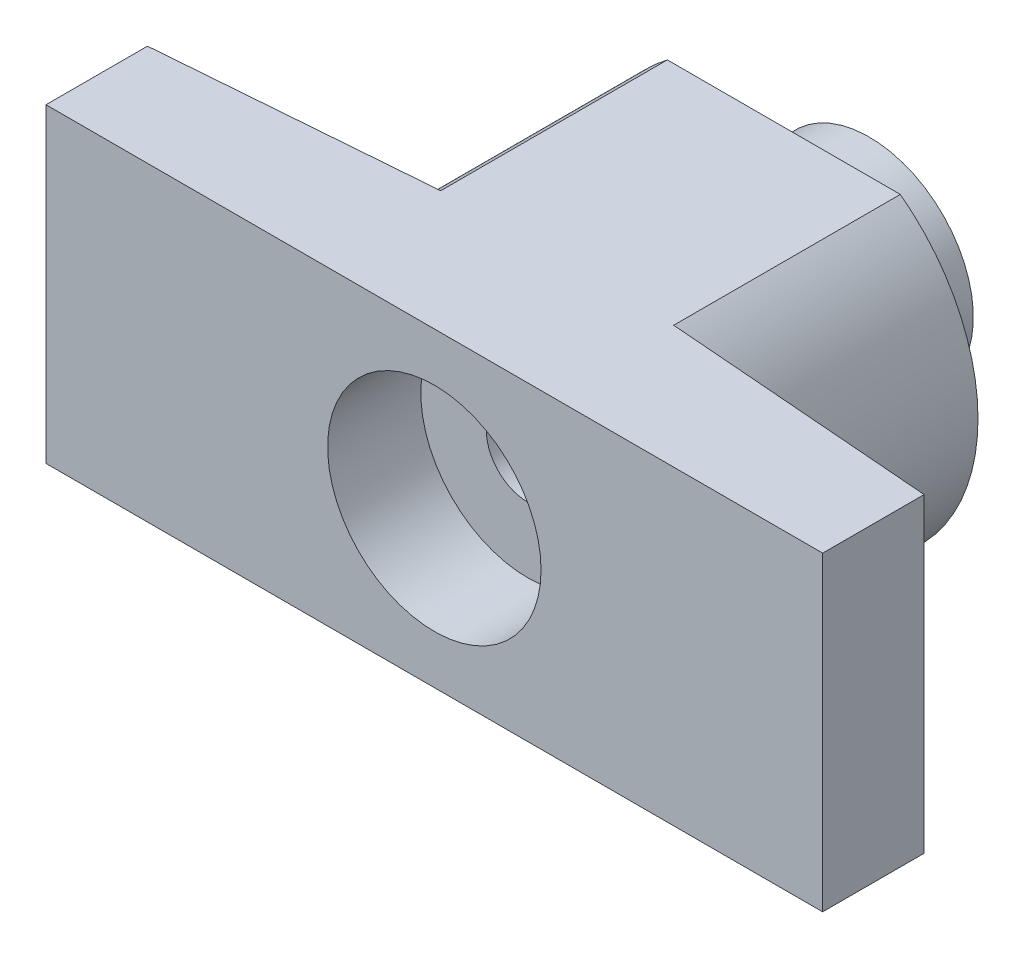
from build123d import *

# Parameters (mm, degrees)
SKETCH1_W           = 63.5
SKETCH1_H           = 25.4
BASE_EXTRUDE_DEPTH  = 10.795
CUT_EXTRUDE3_DEPTH  = 43.068450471
BOSS_EXTRUDE1_DEPTH = 28.575
SKETCH6_R           = 8.509
BOSS_EXTRUDE2_DEPTH = 6.985
SKETCH7_R           = 3.3655
CUT_EXTRUDE4_DEPTH  = 50.334228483
SKETCH8_R           = 8.7249
CUT_EXTRUDE5_DEPTH  = 7.62


with BuildPart() as part:
    # Sketch1 → Base-Extrude (new body)
    with BuildSketch(Plane.XY):
        Rectangle(SKETCH1_W, SKETCH1_H)
    extrude(amount=BASE_EXTRUDE_DEPTH)

    # Sketch4 → Cut-Extrude3 (cut, through all)
    with BuildSketch(Plane.XZ.offset(12.7)):
        Polygon((0, 0), (35.393671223, 2.785542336), (35.393671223, -2.368273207), (-35.393671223, -2.368273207), (-35.393671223, 2.785542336), align=None)
    extrude(amount=-CUT_EXTRUDE3_DEPTH, mode=Mode.SUBTRACT)

    # Sketch5 → Boss-Extrude1 (add)
    with BuildSketch(Plane.XY.offset(10.795)):
        with BuildLine():
            Line((-9.525, 12.7), (9.525, 12.7))
            ThreePointArc((9.525, 12.7), (15.875, 0), (9.525, -12.7))
            Line((9.525, -12.7), (-9.525, -12.7))
            ThreePointArc((-9.525, -12.7), (-15.875, 0), (-9.525, 12.7))
        make_face()
    extrude(amount=-BOSS_EXTRUDE1_DEPTH)

    # Sketch6 → Boss-Extrude2 (add)
    with BuildSketch(Plane(origin=(0, 0, -17.78), x_dir=(-1, 0, 0), z_dir=(0, 0, -1))):
        Circle(SKETCH6_R)
    extrude(amount=BOSS_EXTRUDE2_DEPTH)

    # Sketch7 → Cut-Extrude4 (cut, through all)
    with BuildSketch(Plane(origin=(0, 0, -24.765), x_dir=(-1, 0, 0), z_dir=(0, 0, -1))):
        Circle(SKETCH7_R)
    extrude(amount=-CUT_EXTRUDE4_DEPTH, mode=Mode.SUBTRACT)

    # Sketch8 → Cut-Extrude5 (cut)
    with BuildSketch(Plane.XY.offset(10.795)):
        Circle(SKETCH8_R)
    extrude(amount=-CUT_EXTRUDE5_DEPTH, mode=Mode.SUBTRACT)


solid = part.part
